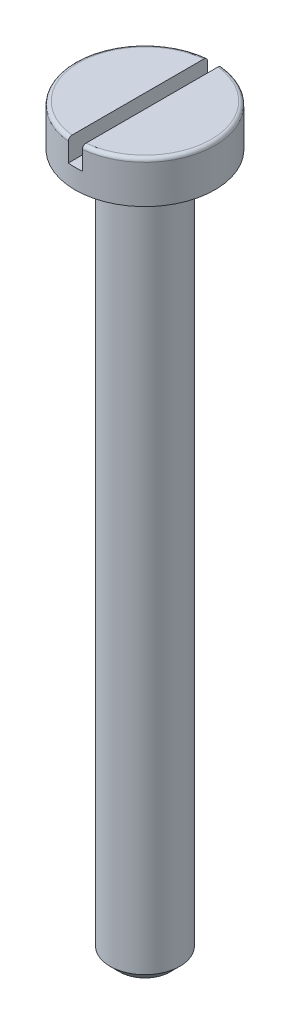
ISO-10303-21;
HEADER;
FILE_DESCRIPTION(('STEP AP214'),'2;1');
FILE_NAME('part.step','',(''),(''),'','','');
FILE_SCHEMA(('AUTOMOTIVE_DESIGN { 1 0 10303 214 1 1 1 1 }'));
ENDSEC;
DATA;
#1=APPLICATION_CONTEXT('core data for automotive mechanical design processes');
#2=APPLICATION_PROTOCOL_DEFINITION('international standard','automotive_design',2000,#1);
#3=PRODUCT_CONTEXT('',#1,'mechanical');
#4=PRODUCT('Part','Part','',(#3));
#5=PRODUCT_RELATED_PRODUCT_CATEGORY('part','',(#4));
#6=PRODUCT_DEFINITION_FORMATION('','',#4);
#7=PRODUCT_DEFINITION_CONTEXT('part definition',#1,'design');
#8=PRODUCT_DEFINITION('design','',#6,#7);
#9=PRODUCT_DEFINITION_SHAPE('','',#8);
#10=(LENGTH_UNIT() NAMED_UNIT(*) SI_UNIT(.MILLI.,.METRE.));
#11=(NAMED_UNIT(*) PLANE_ANGLE_UNIT() SI_UNIT($,.RADIAN.));
#12=(NAMED_UNIT(*) SI_UNIT($,.STERADIAN.) SOLID_ANGLE_UNIT());
#13=UNCERTAINTY_MEASURE_WITH_UNIT(LENGTH_MEASURE(1.E-05),#10,'distance_accuracy_value','');
#14=(GEOMETRIC_REPRESENTATION_CONTEXT(3) GLOBAL_UNCERTAINTY_ASSIGNED_CONTEXT((#13)) GLOBAL_UNIT_ASSIGNED_CONTEXT((#10,
#11,#12)) REPRESENTATION_CONTEXT('',''));
#15=CARTESIAN_POINT('',(0.,0.,0.));
#16=DIRECTION('',(0.,0.,1.));
#17=DIRECTION('',(1.,0.,0.));
#18=AXIS2_PLACEMENT_3D('',#15,#16,#17);
#19=CARTESIAN_POINT('',(0.,1.5,0.));
#20=DIRECTION('',(0.,-1.,0.));
#21=DIRECTION('',(0.,0.,-1.));
#22=AXIS2_PLACEMENT_3D('',#19,#20,#21);
#23=PLANE('',#22);
#24=CARTESIAN_POINT('',(0.,1.5,0.));
#25=DIRECTION('',(0.,1.,0.));
#26=DIRECTION('',(0.,0.,1.));
#27=AXIS2_PLACEMENT_3D('',#24,#25,#26);
#28=CIRCLE('',#27,2.37);
#29=CARTESIAN_POINT('',(-0.25,1.5,-2.35677746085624));
#30=VERTEX_POINT('',#29);
#31=CARTESIAN_POINT('',(-0.25,1.5,2.35677746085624));
#32=VERTEX_POINT('',#31);
#33=EDGE_CURVE('E96',#30,#32,#28,.T.);
#34=ORIENTED_EDGE('',*,*,#33,.T.);
#35=DIRECTION('',(0.,0.,1.));
#36=VECTOR('',#35,1.);
#37=CARTESIAN_POINT('',(-0.25,1.5,-2.5));
#38=LINE('',#37,#36);
#39=EDGE_CURVE('E87',#30,#32,#38,.T.);
#40=ORIENTED_EDGE('',*,*,#39,.F.);
#41=EDGE_LOOP('',(#34,#40));
#42=FACE_BOUND('',#41,.T.);
#43=ADVANCED_FACE('F33',(#42),#23,.F.);
#44=CARTESIAN_POINT('',(0.,1.37,0.));
#45=DIRECTION('',(0.,1.,0.));
#46=DIRECTION('',(0.,0.,1.));
#47=AXIS2_PLACEMENT_3D('',#44,#45,#46);
#48=TOROIDAL_SURFACE('',#47,2.37,0.13);
#49=ORIENTED_EDGE('',*,*,#33,.F.);
#50=CARTESIAN_POINT('',(-0.25,1.43911937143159,-2.46746982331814));
#51=CARTESIAN_POINT('',(-0.25,1.43296494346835,-2.47135281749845));
#52=CARTESIAN_POINT('',(-0.25,1.42647907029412,-2.47472015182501));
#53=CARTESIAN_POINT('',(-0.25,1.41302891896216,-2.48032132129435));
#54=CARTESIAN_POINT('',(-0.25,1.40606409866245,-2.4825538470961));
#55=CARTESIAN_POINT('',(-0.25,1.39186015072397,-2.48581591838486));
#56=CARTESIAN_POINT('',(-0.25,1.38462112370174,-2.48684590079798));
#57=CARTESIAN_POINT('',(-0.25,1.37007485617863,-2.48767352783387));
#58=CARTESIAN_POINT('',(-0.25,1.36276763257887,-2.48747147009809));
#59=CARTESIAN_POINT('',(-0.25,1.34830107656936,-2.48584291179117));
#60=CARTESIAN_POINT('',(-0.25,1.34114155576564,-2.48441808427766));
#61=CARTESIAN_POINT('',(-0.25,1.32716277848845,-2.48038766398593));
#62=CARTESIAN_POINT('',(-0.25,1.32034353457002,-2.47778202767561));
#63=CARTESIAN_POINT('',(-0.25,1.30723188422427,-2.47146272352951));
#64=CARTESIAN_POINT('',(-0.25,1.30093995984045,-2.46774805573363));
#65=CARTESIAN_POINT('',(-0.25,1.28906611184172,-2.45931875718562));
#66=CARTESIAN_POINT('',(-0.25,1.2834841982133,-2.45460411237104));
#67=CARTESIAN_POINT('',(-0.25,1.27316640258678,-2.44429081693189));
#68=CARTESIAN_POINT('',(-0.25,1.26843369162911,-2.43868899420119));
#69=CARTESIAN_POINT('',(-0.25,1.25997030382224,-2.4267736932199));
#70=CARTESIAN_POINT('',(-0.25,1.25623965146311,-2.42046019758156));
#71=CARTESIAN_POINT('',(-0.25,1.24986634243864,-2.40726673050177));
#72=CARTESIAN_POINT('',(-0.25,1.24722926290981,-2.40038406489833));
#73=CARTESIAN_POINT('',(-0.25,1.24314226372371,-2.38627484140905));
#74=CARTESIAN_POINT('',(-0.25,1.24169237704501,-2.37904827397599));
#75=CARTESIAN_POINT('',(-0.25,1.24001521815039,-2.36442203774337));
#76=CARTESIAN_POINT('',(-0.25,1.23979340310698,-2.35702174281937));
#77=CARTESIAN_POINT('',(-0.25,1.24059274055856,-2.34228852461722));
#78=CARTESIAN_POINT('',(-0.25,1.24161391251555,-2.33495560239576));
#79=CARTESIAN_POINT('',(-0.25,1.24487407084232,-2.32055094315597));
#80=CARTESIAN_POINT('',(-0.25,1.24711535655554,-2.31347972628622));
#81=CARTESIAN_POINT('',(-0.25,1.2527552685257,-2.29981484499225));
#82=CARTESIAN_POINT('',(-0.25,1.25615389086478,-2.2932211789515));
#83=CARTESIAN_POINT('',(-0.25,1.26400708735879,-2.28071187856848));
#84=CARTESIAN_POINT('',(-0.25,1.26845980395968,-2.27479507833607));
#85=CARTESIAN_POINT('',(-0.25,1.27829987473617,-2.26379762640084));
#86=CARTESIAN_POINT('',(-0.25,1.28368720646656,-2.25871695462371));
#87=CARTESIAN_POINT('',(-0.25,1.2952158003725,-2.24956319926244));
#88=CARTESIAN_POINT('',(-0.25,1.30135323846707,-2.24548529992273));
#89=CARTESIAN_POINT('',(-0.25,1.31422883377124,-2.23842492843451));
#90=CARTESIAN_POINT('',(-0.25,1.32096697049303,-2.23544241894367));
#91=CARTESIAN_POINT('',(-0.25,1.3348099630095,-2.23067557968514));
#92=CARTESIAN_POINT('',(-0.25,1.34191242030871,-2.22888428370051));
#93=CARTESIAN_POINT('',(-0.25,1.3563176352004,-2.22652489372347));
#94=CARTESIAN_POINT('',(-0.25,1.36362038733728,-2.22595676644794));
#95=CARTESIAN_POINT('',(-0.25,1.37818766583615,-2.22606033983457));
#96=CARTESIAN_POINT('',(-0.25,1.38545222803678,-2.22672707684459));
#97=CARTESIAN_POINT('',(-0.25,1.39976615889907,-2.22927090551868));
#98=CARTESIAN_POINT('',(-0.25,1.40681552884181,-2.23114798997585));
#99=CARTESIAN_POINT('',(-0.25,1.42049920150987,-2.23605713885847));
#100=CARTESIAN_POINT('',(-0.25,1.42713353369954,-2.23908912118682));
#101=CARTESIAN_POINT('',(-0.25,1.43980169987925,-2.24621970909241));
#102=CARTESIAN_POINT('',(-0.25,1.44583552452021,-2.25031833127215));
#103=CARTESIAN_POINT('',(-0.25,1.45715719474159,-2.25948194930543));
#104=CARTESIAN_POINT('',(-0.25,1.46244205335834,-2.26455063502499));
#105=CARTESIAN_POINT('',(-0.25,1.4720918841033,-2.27549874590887));
#106=CARTESIAN_POINT('',(-0.25,1.47645682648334,-2.28137819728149));
#107=CARTESIAN_POINT('',(-0.25,1.48416996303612,-2.29381777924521));
#108=CARTESIAN_POINT('',(-0.25,1.48751205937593,-2.30038169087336));
#109=CARTESIAN_POINT('',(-0.25,1.49305316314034,-2.31397547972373));
#110=CARTESIAN_POINT('',(-0.25,1.49525213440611,-2.32100537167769));
#111=CARTESIAN_POINT('',(-0.25,1.498454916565,-2.33536951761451));
#112=CARTESIAN_POINT('',(-0.25,1.49945266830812,-2.34270512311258));
#113=CARTESIAN_POINT('',(-0.25,1.50020513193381,-2.357439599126));
#114=CARTESIAN_POINT('',(-0.25,1.49995987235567,-2.36483846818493));
#115=CARTESIAN_POINT('',(-0.25,1.49823112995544,-2.37950421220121));
#116=CARTESIAN_POINT('',(-0.25,1.4967453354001,-2.38677081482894));
#117=CARTESIAN_POINT('',(-0.25,1.49257232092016,-2.40095268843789));
#118=CARTESIAN_POINT('',(-0.25,1.48988480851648,-2.40786787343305));
#119=CARTESIAN_POINT('',(-0.25,1.48338728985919,-2.42113804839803));
#120=CARTESIAN_POINT('',(-0.25,1.47957864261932,-2.42749370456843));
#121=CARTESIAN_POINT('',(-0.25,1.47094630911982,-2.43946569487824));
#122=CARTESIAN_POINT('',(-0.25,1.46612387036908,-2.44508292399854));
#123=CARTESIAN_POINT('',(-0.25,1.45756075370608,-2.45349644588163));
#124=CARTESIAN_POINT('',(-0.25,1.45408360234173,-2.45656555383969));
#125=CARTESIAN_POINT('',(-0.25,1.44682221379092,-2.46231606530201));
#126=CARTESIAN_POINT('',(-0.25,1.44303797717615,-2.464997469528));
#127=CARTESIAN_POINT('',(-0.25,1.43911937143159,-2.46746982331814));
#128=B_SPLINE_CURVE_WITH_KNOTS('',3,(#50,#51,#52,#53,#54,#55,#56,#57,#58,#59,#60,#61,#62,#63,
#64,#65,#66,#67,#68,#69,#70,#71,#72,#73,#74,#75,#76,#77,#78,#79,#80,#81,#82,#83,#84,#85,#86,#87,
#88,#89,#90,#91,#92,#93,#94,#95,#96,#97,#98,#99,#100,#101,#102,#103,#104,#105,#106,#107,#108,
#109,#110,#111,#112,#113,#114,#115,#116,#117,#118,#119,#120,#121,#122,#123,#124,#125,#126,#127),
.UNSPECIFIED.,.T.,.F.,(4,2,2,2,2,2,2,2,2,2,2,2,2,2,2,2,2,2,2,2,2,2,2,2,2,2,2,2,2,2,2,2,2,2,2,2,
2,2,4),(0.,0.0218141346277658,0.0436533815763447,0.0654846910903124,0.0873107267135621,
0.109106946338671,0.130903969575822,0.152720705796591,0.174537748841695,0.196434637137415,
0.218332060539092,0.240339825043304,0.262348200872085,0.284454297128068,0.306560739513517,
0.328708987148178,0.350857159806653,0.372966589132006,0.395075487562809,0.417076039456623,
0.439075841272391,0.460945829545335,0.482815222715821,0.504596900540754,0.526378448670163,
0.548158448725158,0.569938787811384,0.591803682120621,0.613669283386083,0.635662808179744,
0.65765702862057,0.679761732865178,0.70186592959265,0.724011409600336,0.746162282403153,
0.768286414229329,0.790383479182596,0.804272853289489,0.818162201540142),.UNSPECIFIED.);
#129=CARTESIAN_POINT('',(-0.25,1.36999999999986,-2.48746859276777));
#130=VERTEX_POINT('',#129);
#131=EDGE_CURVE('E84',#30,#130,#128,.T.);
#132=ORIENTED_EDGE('',*,*,#131,.T.);
#133=CARTESIAN_POINT('',(0.,1.37,0.));
#134=DIRECTION('',(0.,1.,0.));
#135=DIRECTION('',(0.,0.,1.));
#136=AXIS2_PLACEMENT_3D('',#133,#134,#135);
#137=CIRCLE('',#136,2.5);
#138=CARTESIAN_POINT('',(-0.25,1.37000000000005,2.48746859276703));
#139=VERTEX_POINT('',#138);
#140=EDGE_CURVE('E103',#130,#139,#137,.T.);
#141=ORIENTED_EDGE('',*,*,#140,.T.);
#142=CARTESIAN_POINT('',(-0.25,1.42827001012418,2.23988223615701));
#143=CARTESIAN_POINT('',(-0.25,1.42178303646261,2.23660967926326));
#144=CARTESIAN_POINT('',(-0.25,1.41501584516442,2.23388116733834));
#145=CARTESIAN_POINT('',(-0.25,1.40111402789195,2.22959648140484));
#146=CARTESIAN_POINT('',(-0.25,1.39397899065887,2.2280416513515));
#147=CARTESIAN_POINT('',(-0.25,1.37955103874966,2.22615388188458));
#148=CARTESIAN_POINT('',(-0.25,1.37225818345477,2.22582049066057));
#149=CARTESIAN_POINT('',(-0.25,1.35772216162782,2.22638464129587));
#150=CARTESIAN_POINT('',(-0.25,1.35047898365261,2.22728188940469));
#151=CARTESIAN_POINT('',(-0.25,1.33625385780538,2.23027853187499));
#152=CARTESIAN_POINT('',(-0.25,1.32927164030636,2.23237664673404));
#153=CARTESIAN_POINT('',(-0.25,1.31575706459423,2.23771263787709));
#154=CARTESIAN_POINT('',(-0.25,1.30922472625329,2.24095056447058));
#155=CARTESIAN_POINT('',(-0.25,1.2967779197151,2.24848114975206));
#156=CARTESIAN_POINT('',(-0.25,1.29086497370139,2.25277632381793));
#157=CARTESIAN_POINT('',(-0.25,1.27983920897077,2.2622934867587));
#158=CARTESIAN_POINT('',(-0.25,1.27472641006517,2.26751549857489));
#159=CARTESIAN_POINT('',(-0.25,1.26541640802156,2.27876789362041));
#160=CARTESIAN_POINT('',(-0.25,1.26122427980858,2.28480247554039));
#161=CARTESIAN_POINT('',(-0.25,1.25390591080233,2.29748658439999));
#162=CARTESIAN_POINT('',(-0.25,1.25077970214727,2.30413612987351));
#163=CARTESIAN_POINT('',(-0.25,1.24566392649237,2.31790205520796));
#164=CARTESIAN_POINT('',(-0.25,1.24368091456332,2.32502087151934));
#165=CARTESIAN_POINT('',(-0.25,1.24093365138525,2.33948996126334));
#166=CARTESIAN_POINT('',(-0.25,1.2401694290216,2.34684024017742));
#167=CARTESIAN_POINT('',(-0.25,1.2398805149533,2.36159008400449));
#168=CARTESIAN_POINT('',(-0.25,1.24036001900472,2.36898973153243));
#169=CARTESIAN_POINT('',(-0.25,1.24255472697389,2.3836035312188));
#170=CARTESIAN_POINT('',(-0.25,1.24426993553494,2.39081768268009));
#171=CARTESIAN_POINT('',(-0.25,1.24888858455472,2.40485327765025));
#172=CARTESIAN_POINT('',(-0.25,1.25179174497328,2.41167481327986));
#173=CARTESIAN_POINT('',(-0.25,1.25870596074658,2.4247312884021));
#174=CARTESIAN_POINT('',(-0.25,1.26271699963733,2.43096623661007));
#175=CARTESIAN_POINT('',(-0.25,1.27171897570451,2.44264879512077));
#176=CARTESIAN_POINT('',(-0.25,1.27670646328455,2.448099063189));
#177=CARTESIAN_POINT('',(-0.25,1.28752981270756,2.45807967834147));
#178=CARTESIAN_POINT('',(-0.25,1.29336565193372,2.46261004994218));
#179=CARTESIAN_POINT('',(-0.25,1.30568850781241,2.47059795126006));
#180=CARTESIAN_POINT('',(-0.25,1.31217209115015,2.47406077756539));
#181=CARTESIAN_POINT('',(-0.25,1.32563049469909,2.47984309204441));
#182=CARTESIAN_POINT('',(-0.25,1.33260530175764,2.48216261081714));
#183=CARTESIAN_POINT('',(-0.25,1.34681431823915,2.48558233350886));
#184=CARTESIAN_POINT('',(-0.25,1.35404721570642,2.48668799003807));
#185=CARTESIAN_POINT('',(-0.25,1.36859587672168,2.48766627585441));
#186=CARTESIAN_POINT('',(-0.25,1.37591163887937,2.48753892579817));
#187=CARTESIAN_POINT('',(-0.25,1.39040100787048,2.48605665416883));
#188=CARTESIAN_POINT('',(-0.25,1.39757489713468,2.48470449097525));
#189=CARTESIAN_POINT('',(-0.25,1.41159411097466,2.48081590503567));
#190=CARTESIAN_POINT('',(-0.25,1.41843943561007,2.47827948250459));
#191=CARTESIAN_POINT('',(-0.25,1.43161392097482,2.47209342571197));
#192=CARTESIAN_POINT('',(-0.25,1.43794264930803,2.46844287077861));
#193=CARTESIAN_POINT('',(-0.25,1.44990025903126,2.46013466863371));
#194=CARTESIAN_POINT('',(-0.25,1.4555291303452,2.45547700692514));
#195=CARTESIAN_POINT('',(-0.25,1.4659494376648,2.44526952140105));
#196=CARTESIAN_POINT('',(-0.25,1.47073779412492,2.43971655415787));
#197=CARTESIAN_POINT('',(-0.25,1.47931984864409,2.42788895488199));
#198=CARTESIAN_POINT('',(-0.25,1.4831135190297,2.42161430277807));
#199=CARTESIAN_POINT('',(-0.25,1.48961873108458,2.40848775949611));
#200=CARTESIAN_POINT('',(-0.25,1.49232474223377,2.40163312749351));
#201=CARTESIAN_POINT('',(-0.25,1.49655338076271,2.38756806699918));
#202=CARTESIAN_POINT('',(-0.25,1.49807597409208,2.38035762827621));
#203=CARTESIAN_POINT('',(-0.25,1.49990072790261,2.36575085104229));
#204=CARTESIAN_POINT('',(-0.25,1.50019735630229,2.35835382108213));
#205=CARTESIAN_POINT('',(-0.25,1.49954724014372,2.34361481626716));
#206=CARTESIAN_POINT('',(-0.25,1.49860052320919,2.33627284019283));
#207=CARTESIAN_POINT('',(-0.25,1.49548711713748,2.32183769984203));
#208=CARTESIAN_POINT('',(-0.25,1.49331813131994,2.31474503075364));
#209=CARTESIAN_POINT('',(-0.25,1.48781759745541,2.30102344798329));
#210=CARTESIAN_POINT('',(-0.25,1.48448576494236,2.29439464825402));
#211=CARTESIAN_POINT('',(-0.25,1.47675756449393,2.28180103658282));
#212=CARTESIAN_POINT('',(-0.25,1.47236243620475,2.27583546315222));
#213=CARTESIAN_POINT('',(-0.25,1.46263145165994,2.26473715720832));
#214=CARTESIAN_POINT('',(-0.25,1.45729675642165,2.25960341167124));
#215=CARTESIAN_POINT('',(-0.25,1.44797002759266,2.25204072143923));
#216=CARTESIAN_POINT('',(-0.25,1.44421445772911,2.24931504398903));
#217=CARTESIAN_POINT('',(-0.25,1.43643395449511,2.24427982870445));
#218=CARTESIAN_POINT('',(-0.25,1.43240902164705,2.24197029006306));
#219=CARTESIAN_POINT('',(-0.25,1.42827001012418,2.23988223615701));
#220=B_SPLINE_CURVE_WITH_KNOTS('',3,(#142,#143,#144,#145,#146,#147,#148,#149,#150,#151,#152,
#153,#154,#155,#156,#157,#158,#159,#160,#161,#162,#163,#164,#165,#166,#167,#168,#169,#170,#171,
#172,#173,#174,#175,#176,#177,#178,#179,#180,#181,#182,#183,#184,#185,#186,#187,#188,#189,#190,
#191,#192,#193,#194,#195,#196,#197,#198,#199,#200,#201,#202,#203,#204,#205,#206,#207,#208,#209,
#210,#211,#212,#213,#214,#215,#216,#217,#218,#219),.UNSPECIFIED.,.T.,.F.,(4,2,2,2,2,2,2,2,2,2,2,
2,2,2,2,2,2,2,2,2,2,2,2,2,2,2,2,2,2,2,2,2,2,2,2,2,2,2,4),(0.,0.0217802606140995,
0.0435854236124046,0.0653825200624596,0.0871744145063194,0.108943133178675,0.130712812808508,
0.152534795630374,0.17435731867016,0.196297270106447,0.218237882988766,0.240303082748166,
0.262368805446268,0.284509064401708,0.306649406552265,0.328784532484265,0.350919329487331,
0.372977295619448,0.395034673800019,0.416980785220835,0.438926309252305,0.460772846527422,
0.48261901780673,0.504416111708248,0.526213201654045,0.548028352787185,0.569843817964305,
0.591737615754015,0.61363202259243,0.635636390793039,0.657641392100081,0.679745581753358,
0.701849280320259,0.723994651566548,0.746145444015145,0.76827053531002,0.790368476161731,
0.804265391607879,0.818162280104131),.UNSPECIFIED.);
#221=EDGE_CURVE('E93',#139,#32,#220,.T.);
#222=ORIENTED_EDGE('',*,*,#221,.T.);
#223=EDGE_LOOP('',(#49,#132,#141,#222));
#224=FACE_BOUND('',#223,.T.);
#225=ADVANCED_FACE('F99',(#224),#48,.T.);
#226=CARTESIAN_POINT('',(0.,-25.,0.));
#227=DIRECTION('',(0.,1.,0.));
#228=DIRECTION('',(0.,0.,1.));
#229=AXIS2_PLACEMENT_3D('',#226,#227,#228);
#230=CYLINDRICAL_SURFACE('',#229,1.25);
#231=CARTESIAN_POINT('',(0.,-24.65,0.));
#232=DIRECTION('',(0.,1.,0.));
#233=DIRECTION('',(0.,0.,1.));
#234=AXIS2_PLACEMENT_3D('',#231,#232,#233);
#235=CIRCLE('',#234,1.25);
#236=CARTESIAN_POINT('',(0.,-24.65,1.25));
#237=VERTEX_POINT('',#236);
#238=EDGE_CURVE('E116',#237,#237,#235,.T.);
#239=ORIENTED_EDGE('',*,*,#238,.T.);
#240=EDGE_LOOP('',(#239));
#241=FACE_BOUND('',#240,.T.);
#242=CARTESIAN_POINT('',(0.,0.,0.));
#243=DIRECTION('',(0.,1.,0.));
#244=DIRECTION('',(0.,0.,1.));
#245=AXIS2_PLACEMENT_3D('',#242,#243,#244);
#246=CIRCLE('',#245,1.25);
#247=CARTESIAN_POINT('',(0.,0.,1.25));
#248=VERTEX_POINT('',#247);
#249=EDGE_CURVE('E113',#248,#248,#246,.T.);
#250=ORIENTED_EDGE('',*,*,#249,.F.);
#251=EDGE_LOOP('',(#250));
#252=FACE_BOUND('',#251,.T.);
#253=ADVANCED_FACE('F184',(#241,#252),#230,.T.);
#254=CARTESIAN_POINT('',(0.,-25.,0.));
#255=DIRECTION('',(0.,1.,0.));
#256=DIRECTION('',(0.,0.,1.));
#257=AXIS2_PLACEMENT_3D('',#254,#255,#256);
#258=PLANE('',#257);
#259=CARTESIAN_POINT('',(0.,-25.,0.));
#260=DIRECTION('',(0.,1.,0.));
#261=DIRECTION('',(0.,0.,1.));
#262=AXIS2_PLACEMENT_3D('',#259,#260,#261);
#263=CIRCLE('',#262,0.899999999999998);
#264=CARTESIAN_POINT('',(0.,-25.,0.899999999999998));
#265=VERTEX_POINT('',#264);
#266=EDGE_CURVE('E119',#265,#265,#263,.F.);
#267=ORIENTED_EDGE('',*,*,#266,.T.);
#268=EDGE_LOOP('',(#267));
#269=FACE_BOUND('',#268,.T.);
#270=ADVANCED_FACE('F194',(#269),#258,.F.);
#271=CARTESIAN_POINT('',(0.,-24.65,0.));
#272=DIRECTION('',(0.,1.,0.));
#273=DIRECTION('',(0.,0.,1.));
#274=AXIS2_PLACEMENT_3D('',#271,#272,#273);
#275=CONICAL_SURFACE('',#274,1.25,0.785398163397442);
#276=ORIENTED_EDGE('',*,*,#266,.F.);
#277=EDGE_LOOP('',(#276));
#278=FACE_BOUND('',#277,.T.);
#279=ORIENTED_EDGE('',*,*,#238,.F.);
#280=EDGE_LOOP('',(#279));
#281=FACE_BOUND('',#280,.T.);
#282=ADVANCED_FACE('F35',(#278,#281),#275,.T.);
#283=CARTESIAN_POINT('',(0.25,1.5,2.35677746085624));
#284=VERTEX_POINT('',#283);
#285=CARTESIAN_POINT('',(0.25,1.5,-2.35677746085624));
#286=VERTEX_POINT('',#285);
#287=EDGE_CURVE('E100',#284,#286,#28,.T.);
#288=ORIENTED_EDGE('',*,*,#287,.T.);
#289=DIRECTION('',(0.,0.,-1.));
#290=VECTOR('',#289,1.);
#291=CARTESIAN_POINT('',(0.25,1.5,-2.5));
#292=LINE('',#291,#290);
#293=EDGE_CURVE('E97',#284,#286,#292,.T.);
#294=ORIENTED_EDGE('',*,*,#293,.F.);
#295=EDGE_LOOP('',(#288,#294));
#296=FACE_BOUND('',#295,.T.);
#297=ADVANCED_FACE('F158',(#296),#23,.F.);
#298=CARTESIAN_POINT('',(0.,0.,0.));
#299=DIRECTION('',(0.,1.,0.));
#300=DIRECTION('',(0.,0.,1.));
#301=AXIS2_PLACEMENT_3D('',#298,#299,#300);
#302=PLANE('',#301);
#303=ORIENTED_EDGE('',*,*,#249,.T.);
#304=EDGE_LOOP('',(#303));
#305=FACE_BOUND('',#304,.T.);
#306=CARTESIAN_POINT('',(0.,0.,0.));
#307=DIRECTION('',(0.,1.,0.));
#308=DIRECTION('',(0.,0.,1.));
#309=AXIS2_PLACEMENT_3D('',#306,#307,#308);
#310=CIRCLE('',#309,2.5);
#311=CARTESIAN_POINT('',(0.,0.,2.5));
#312=VERTEX_POINT('',#311);
#313=EDGE_CURVE('E110',#312,#312,#310,.T.);
#314=ORIENTED_EDGE('',*,*,#313,.F.);
#315=EDGE_LOOP('',(#314));
#316=FACE_BOUND('',#315,.T.);
#317=ADVANCED_FACE('F188',(#305,#316),#302,.F.);
#318=CARTESIAN_POINT('',(0.,1.3,0.));
#319=DIRECTION('',(0.,1.,0.));
#320=DIRECTION('',(0.,0.,1.));
#321=AXIS2_PLACEMENT_3D('',#318,#319,#320);
#322=CYLINDRICAL_SURFACE('',#321,2.5);
#323=ORIENTED_EDGE('',*,*,#140,.F.);
#324=DIRECTION('',(0.,1.,0.));
#325=VECTOR('',#324,1.);
#326=CARTESIAN_POINT('',(-0.25,1.3,-2.48746859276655));
#327=LINE('',#326,#325);
#328=CARTESIAN_POINT('',(-0.25,0.7,-2.48746859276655));
#329=VERTEX_POINT('',#328);
#330=EDGE_CURVE('E56',#130,#329,#327,.F.);
#331=ORIENTED_EDGE('',*,*,#330,.T.);
#332=CARTESIAN_POINT('',(0.,0.7,0.));
#333=DIRECTION('',(0.,1.,0.));
#334=DIRECTION('',(0.,0.,1.));
#335=AXIS2_PLACEMENT_3D('',#332,#333,#334);
#336=CIRCLE('',#335,2.5);
#337=CARTESIAN_POINT('',(0.25,0.7,-2.48746859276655));
#338=VERTEX_POINT('',#337);
#339=EDGE_CURVE('E11',#338,#329,#336,.T.);
#340=ORIENTED_EDGE('',*,*,#339,.F.);
#341=DIRECTION('',(0.,1.,0.));
#342=VECTOR('',#341,1.);
#343=CARTESIAN_POINT('',(0.25,1.3,-2.48746859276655));
#344=LINE('',#343,#342);
#345=CARTESIAN_POINT('',(0.25,1.37,-2.48746859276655));
#346=VERTEX_POINT('',#345);
#347=EDGE_CURVE('E167',#338,#346,#344,.T.);
#348=ORIENTED_EDGE('',*,*,#347,.T.);
#349=CARTESIAN_POINT('',(0.25,1.37,2.48746859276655));
#350=VERTEX_POINT('',#349);
#351=EDGE_CURVE('E109',#350,#346,#137,.T.);
#352=ORIENTED_EDGE('',*,*,#351,.F.);
#353=DIRECTION('',(0.,1.,0.));
#354=VECTOR('',#353,1.);
#355=CARTESIAN_POINT('',(0.25,1.3,2.48746859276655));
#356=LINE('',#355,#354);
#357=CARTESIAN_POINT('',(0.25,0.7,2.48746859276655));
#358=VERTEX_POINT('',#357);
#359=EDGE_CURVE('E48',#350,#358,#356,.F.);
#360=ORIENTED_EDGE('',*,*,#359,.T.);
#361=CARTESIAN_POINT('',(-0.25,0.7,2.48746859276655));
#362=VERTEX_POINT('',#361);
#363=EDGE_CURVE('E37',#362,#358,#336,.T.);
#364=ORIENTED_EDGE('',*,*,#363,.F.);
#365=DIRECTION('',(0.,1.,0.));
#366=VECTOR('',#365,1.);
#367=CARTESIAN_POINT('',(-0.25,1.3,2.48746859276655));
#368=LINE('',#367,#366);
#369=EDGE_CURVE('E104',#362,#139,#368,.T.);
#370=ORIENTED_EDGE('',*,*,#369,.T.);
#371=EDGE_LOOP('',(#323,#331,#340,#348,#352,#360,#364,#370));
#372=FACE_BOUND('',#371,.T.);
#373=ORIENTED_EDGE('',*,*,#313,.T.);
#374=EDGE_LOOP('',(#373));
#375=FACE_BOUND('',#374,.T.);
#376=ADVANCED_FACE('F171',(#372,#375),#322,.T.);
#377=ORIENTED_EDGE('',*,*,#351,.T.);
#378=CARTESIAN_POINT('',(0.25,1.43911937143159,-2.46746982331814));
#379=CARTESIAN_POINT('',(0.25,1.44531290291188,-2.4635613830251));
#380=CARTESIAN_POINT('',(0.25,1.45117973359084,-2.45912493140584));
#381=CARTESIAN_POINT('',(0.25,1.46208885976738,-2.44932494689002));
#382=CARTESIAN_POINT('',(0.25,1.46713010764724,-2.44396025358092));
#383=CARTESIAN_POINT('',(0.25,1.47623837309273,-2.43246478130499));
#384=CARTESIAN_POINT('',(0.25,1.48030606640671,-2.42633453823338));
#385=CARTESIAN_POINT('',(0.25,1.48735776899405,-2.41348197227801));
#386=CARTESIAN_POINT('',(0.25,1.49034204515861,-2.40675979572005));
#387=CARTESIAN_POINT('',(0.25,1.49515638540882,-2.39288535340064));
#388=CARTESIAN_POINT('',(0.25,1.49698200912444,-2.38573154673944));
#389=CARTESIAN_POINT('',(0.25,1.49941139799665,-2.37121906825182));
#390=CARTESIAN_POINT('',(0.25,1.50001508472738,-2.36386038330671));
#391=CARTESIAN_POINT('',(0.25,1.49998428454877,-2.3491179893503));
#392=CARTESIAN_POINT('',(0.25,1.49934515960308,-2.34173428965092));
#393=CARTESIAN_POINT('',(0.25,1.49683735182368,-2.32717865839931));
#394=CARTESIAN_POINT('',(0.25,1.49496865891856,-2.3200067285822));
#395=CARTESIAN_POINT('',(0.25,1.490051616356,-2.3060736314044));
#396=CARTESIAN_POINT('',(0.25,1.48700245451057,-2.29931275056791));
#397=CARTESIAN_POINT('',(0.25,1.47980910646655,-2.28640093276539));
#398=CARTESIAN_POINT('',(0.25,1.47566493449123,-2.28024998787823));
#399=CARTESIAN_POINT('',(0.25,1.46641129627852,-2.26875323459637));
#400=CARTESIAN_POINT('',(0.25,1.46130474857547,-2.26340507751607));
#401=CARTESIAN_POINT('',(0.25,1.45026180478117,-2.25364782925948));
#402=CARTESIAN_POINT('',(0.25,1.44432543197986,-2.24923871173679));
#403=CARTESIAN_POINT('',(0.25,1.43182649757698,-2.24151111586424));
#404=CARTESIAN_POINT('',(0.25,1.42526759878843,-2.23818671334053));
#405=CARTESIAN_POINT('',(0.25,1.41168257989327,-2.23269332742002));
#406=CARTESIAN_POINT('',(0.25,1.40465647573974,-2.23052430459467));
#407=CARTESIAN_POINT('',(0.25,1.39037852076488,-2.22741492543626));
#408=CARTESIAN_POINT('',(0.25,1.38312814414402,-2.22646779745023));
#409=CARTESIAN_POINT('',(0.25,1.36857150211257,-2.22580800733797));
#410=CARTESIAN_POINT('',(0.25,1.36126523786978,-2.22609531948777));
#411=CARTESIAN_POINT('',(0.25,1.3468256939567,-2.22789329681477));
#412=CARTESIAN_POINT('',(0.25,1.33969198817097,-2.22940054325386));
#413=CARTESIAN_POINT('',(0.25,1.32577834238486,-2.23358966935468));
#414=CARTESIAN_POINT('',(0.25,1.3189984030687,-2.23627155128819));
#415=CARTESIAN_POINT('',(0.25,1.30597364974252,-2.24273619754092));
#416=CARTESIAN_POINT('',(0.25,1.29972960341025,-2.2465205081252));
#417=CARTESIAN_POINT('',(0.25,1.28796144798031,-2.25507891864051));
#418=CARTESIAN_POINT('',(0.25,1.28243735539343,-2.25985304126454));
#419=CARTESIAN_POINT('',(0.25,1.27223671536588,-2.27027985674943));
#420=CARTESIAN_POINT('',(0.25,1.26756441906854,-2.27593670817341));
#421=CARTESIAN_POINT('',(0.25,1.25922921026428,-2.2879506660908));
#422=CARTESIAN_POINT('',(0.25,1.25556632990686,-2.29430779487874));
#423=CARTESIAN_POINT('',(0.25,1.2493316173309,-2.30758200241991));
#424=CARTESIAN_POINT('',(0.25,1.24676632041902,-2.31450215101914));
#425=CARTESIAN_POINT('',(0.25,1.24282849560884,-2.32867390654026));
#426=CARTESIAN_POINT('',(0.25,1.24145599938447,-2.33592552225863));
#427=CARTESIAN_POINT('',(0.25,1.23993838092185,-2.3505865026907));
#428=CARTESIAN_POINT('',(0.25,1.23979835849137,-2.35799639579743));
#429=CARTESIAN_POINT('',(0.25,1.24076330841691,-2.37273473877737));
#430=CARTESIAN_POINT('',(0.25,1.24186829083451,-2.38006318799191));
#431=CARTESIAN_POINT('',(0.25,1.24529448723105,-2.39443552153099));
#432=CARTESIAN_POINT('',(0.25,1.24761653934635,-2.40147920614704));
#433=CARTESIAN_POINT('',(0.25,1.25341345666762,-2.41507516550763));
#434=CARTESIAN_POINT('',(0.25,1.25688831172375,-2.42162744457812));
#435=CARTESIAN_POINT('',(0.25,1.264882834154,-2.43403436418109));
#436=CARTESIAN_POINT('',(0.25,1.26939956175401,-2.43989089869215));
#437=CARTESIAN_POINT('',(0.25,1.27935653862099,-2.45075789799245));
#438=CARTESIAN_POINT('',(0.25,1.28479676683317,-2.4557683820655));
#439=CARTESIAN_POINT('',(0.25,1.29641830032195,-2.46477503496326));
#440=CARTESIAN_POINT('',(0.25,1.30259589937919,-2.46877598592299));
#441=CARTESIAN_POINT('',(0.25,1.3155374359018,-2.47567791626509));
#442=CARTESIAN_POINT('',(0.25,1.32230133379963,-2.47857896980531));
#443=CARTESIAN_POINT('',(0.25,1.33618770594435,-2.48318462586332));
#444=CARTESIAN_POINT('',(0.25,1.34330824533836,-2.48489506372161));
#445=CARTESIAN_POINT('',(0.25,1.35773763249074,-2.48709264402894));
#446=CARTESIAN_POINT('',(0.25,1.36504652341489,-2.48757950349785));
#447=CARTESIAN_POINT('',(0.25,1.37962324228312,-2.4873155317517));
#448=CARTESIAN_POINT('',(0.25,1.38689112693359,-2.48656772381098));
#449=CARTESIAN_POINT('',(0.25,1.40119172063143,-2.48386209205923));
#450=CARTESIAN_POINT('',(0.25,1.40822470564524,-2.48190574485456));
#451=CARTESIAN_POINT('',(0.25,1.41924547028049,-2.47781537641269));
#452=CARTESIAN_POINT('',(0.25,1.42336845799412,-2.4760359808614));
#453=CARTESIAN_POINT('',(0.25,1.43140829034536,-2.47206038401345));
#454=CARTESIAN_POINT('',(0.25,1.43532513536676,-2.46986418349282));
#455=CARTESIAN_POINT('',(0.25,1.43911937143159,-2.46746982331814));
#456=B_SPLINE_CURVE_WITH_KNOTS('',3,(#378,#379,#380,#381,#382,#383,#384,#385,#386,#387,#388,
#389,#390,#391,#392,#393,#394,#395,#396,#397,#398,#399,#400,#401,#402,#403,#404,#405,#406,#407,
#408,#409,#410,#411,#412,#413,#414,#415,#416,#417,#418,#419,#420,#421,#422,#423,#424,#425,#426,
#427,#428,#429,#430,#431,#432,#433,#434,#435,#436,#437,#438,#439,#440,#441,#442,#443,#444,#445,
#446,#447,#448,#449,#450,#451,#452,#453,#454,#455),.UNSPECIFIED.,.T.,.F.,(4,2,2,2,2,2,2,2,2,2,2,
2,2,2,2,2,2,2,2,2,2,2,2,2,2,2,2,2,2,2,2,2,2,2,2,2,2,2,4),(0.,0.0219544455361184,
0.0439365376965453,0.0659033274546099,0.0878647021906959,0.109909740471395,0.131956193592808,
0.154085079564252,0.176214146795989,0.19835846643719,0.22050249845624,0.242580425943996,
0.264657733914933,0.286612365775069,0.308566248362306,0.330397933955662,0.352229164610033,
0.373999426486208,0.395769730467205,0.417570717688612,0.43937220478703,0.461279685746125,
0.483187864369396,0.505224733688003,0.527262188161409,0.549390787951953,0.571519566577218,
0.593663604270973,0.615807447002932,0.637889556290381,0.659971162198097,0.681946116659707,
0.703919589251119,0.725784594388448,0.747654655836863,0.769471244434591,0.791261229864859,
0.804710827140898,0.818160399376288),.UNSPECIFIED.);
#457=EDGE_CURVE('E128',#346,#286,#456,.T.);
#458=ORIENTED_EDGE('',*,*,#457,.T.);
#459=ORIENTED_EDGE('',*,*,#287,.F.);
#460=CARTESIAN_POINT('',(0.25,1.42827001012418,2.23988223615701));
#461=CARTESIAN_POINT('',(0.25,1.43480328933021,2.24317888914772));
#462=CARTESIAN_POINT('',(0.25,1.44106182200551,2.24703226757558));
#463=CARTESIAN_POINT('',(0.25,1.45284696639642,2.25574000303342));
#464=CARTESIAN_POINT('',(0.25,1.45837264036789,2.2605956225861));
#465=CARTESIAN_POINT('',(0.25,1.4685279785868,2.27116134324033));
#466=CARTESIAN_POINT('',(0.25,1.47315829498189,2.27687081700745));
#467=CARTESIAN_POINT('',(0.25,1.48139817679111,2.28898159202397));
#468=CARTESIAN_POINT('',(0.25,1.48500799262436,2.2953827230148));
#469=CARTESIAN_POINT('',(0.25,1.49112338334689,2.30872636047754));
#470=CARTESIAN_POINT('',(0.25,1.49362405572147,2.31567111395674));
#471=CARTESIAN_POINT('',(0.25,1.49742942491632,2.3298812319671));
#472=CARTESIAN_POINT('',(0.25,1.49873404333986,2.33714661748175));
#473=CARTESIAN_POINT('',(0.25,1.50011402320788,2.35182294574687));
#474=CARTESIAN_POINT('',(0.25,1.50018439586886,2.35923435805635));
#475=CARTESIAN_POINT('',(0.25,1.49908074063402,2.37396400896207));
#476=CARTESIAN_POINT('',(0.25,1.49790670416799,2.38128224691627));
#477=CARTESIAN_POINT('',(0.25,1.4943450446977,2.39562189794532));
#478=CARTESIAN_POINT('',(0.25,1.49195670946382,2.4026431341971));
#479=CARTESIAN_POINT('',(0.25,1.48603186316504,2.416183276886));
#480=CARTESIAN_POINT('',(0.25,1.48249536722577,2.42270218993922));
#481=CARTESIAN_POINT('',(0.25,1.47438445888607,2.43503198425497));
#482=CARTESIAN_POINT('',(0.25,1.46981305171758,2.44084484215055));
#483=CARTESIAN_POINT('',(0.25,1.45975484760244,2.45161585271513));
#484=CARTESIAN_POINT('',(0.25,1.45426807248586,2.45657402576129));
#485=CARTESIAN_POINT('',(0.25,1.44256343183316,2.46546896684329));
#486=CARTESIAN_POINT('',(0.25,1.43634926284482,2.46941059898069));
#487=CARTESIAN_POINT('',(0.25,1.42334490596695,2.47618877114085));
#488=CARTESIAN_POINT('',(0.25,1.41655473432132,2.47902534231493));
#489=CARTESIAN_POINT('',(0.25,1.40262620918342,2.48349918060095));
#490=CARTESIAN_POINT('',(0.25,1.39548968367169,2.485142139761));
#491=CARTESIAN_POINT('',(0.25,1.38104190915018,2.4872027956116));
#492=CARTESIAN_POINT('',(0.25,1.37373066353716,2.48762051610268));
#493=CARTESIAN_POINT('',(0.25,1.35916318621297,2.48721905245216));
#494=CARTESIAN_POINT('',(0.25,1.35190685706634,2.48640339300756));
#495=CARTESIAN_POINT('',(0.25,1.33763417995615,2.48356551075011));
#496=CARTESIAN_POINT('',(0.25,1.33061783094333,2.48154329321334));
#497=CARTESIAN_POINT('',(0.25,1.31702265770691,2.4763508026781));
#498=CARTESIAN_POINT('',(0.25,1.31044389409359,2.47318037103));
#499=CARTESIAN_POINT('',(0.25,1.2979098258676,2.46578325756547));
#500=CARTESIAN_POINT('',(0.25,1.29195452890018,2.46155656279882));
#501=CARTESIAN_POINT('',(0.25,1.28081627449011,2.45215381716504));
#502=CARTESIAN_POINT('',(0.25,1.27563574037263,2.44697489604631));
#503=CARTESIAN_POINT('',(0.25,1.26621257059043,2.43582452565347));
#504=CARTESIAN_POINT('',(0.25,1.26196995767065,2.4298530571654));
#505=CARTESIAN_POINT('',(0.25,1.25452094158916,2.417256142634));
#506=CARTESIAN_POINT('',(0.25,1.25131967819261,2.41062765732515));
#507=CARTESIAN_POINT('',(0.25,1.24606935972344,2.39692908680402));
#508=CARTESIAN_POINT('',(0.25,1.24402033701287,2.38985898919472));
#509=CARTESIAN_POINT('',(0.25,1.24112311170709,2.37544159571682));
#510=CARTESIAN_POINT('',(0.25,1.24028070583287,2.36809313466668));
#511=CARTESIAN_POINT('',(0.25,1.23983791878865,2.35335884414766));
#512=CARTESIAN_POINT('',(0.25,1.24023756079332,2.3459730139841));
#513=CARTESIAN_POINT('',(0.25,1.24227036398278,2.33135279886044));
#514=CARTESIAN_POINT('',(0.25,1.24390682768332,2.32411887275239));
#515=CARTESIAN_POINT('',(0.25,1.24837191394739,2.31002868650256));
#516=CARTESIAN_POINT('',(0.25,1.25120054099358,2.30317242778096));
#517=CARTESIAN_POINT('',(0.25,1.25796880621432,2.29003909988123));
#518=CARTESIAN_POINT('',(0.25,1.26190753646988,2.28376156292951));
#519=CARTESIAN_POINT('',(0.25,1.27078722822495,2.27196046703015));
#520=CARTESIAN_POINT('',(0.25,1.27572817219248,2.26643689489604));
#521=CARTESIAN_POINT('',(0.25,1.28645035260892,2.25632637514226));
#522=CARTESIAN_POINT('',(0.25,1.29222793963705,2.25173555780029));
#523=CARTESIAN_POINT('',(0.25,1.3044754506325,2.24359610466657));
#524=CARTESIAN_POINT('',(0.25,1.31094532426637,2.24004739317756));
#525=CARTESIAN_POINT('',(0.25,1.32435209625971,2.2341150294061));
#526=CARTESIAN_POINT('',(0.25,1.33128594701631,2.23172448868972));
#527=CARTESIAN_POINT('',(0.25,1.34545952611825,2.22814716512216));
#528=CARTESIAN_POINT('',(0.25,1.35269932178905,2.22696064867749));
#529=CARTESIAN_POINT('',(0.25,1.36724346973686,2.22582979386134));
#530=CARTESIAN_POINT('',(0.25,1.37454741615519,2.22588019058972));
#531=CARTESIAN_POINT('',(0.25,1.38903647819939,2.22720915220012));
#532=CARTESIAN_POINT('',(0.25,1.39622172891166,2.2284862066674));
#533=CARTESIAN_POINT('',(0.25,1.40756582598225,2.23150514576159));
#534=CARTESIAN_POINT('',(0.25,1.41182600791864,2.23287947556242));
#535=CARTESIAN_POINT('',(0.25,1.4201816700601,2.23606063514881));
#536=CARTESIAN_POINT('',(0.25,1.42427715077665,2.23786746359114));
#537=CARTESIAN_POINT('',(0.25,1.42827001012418,2.23988223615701));
#538=B_SPLINE_CURVE_WITH_KNOTS('',3,(#460,#461,#462,#463,#464,#465,#466,#467,#468,#469,#470,
#471,#472,#473,#474,#475,#476,#477,#478,#479,#480,#481,#482,#483,#484,#485,#486,#487,#488,#489,
#490,#491,#492,#493,#494,#495,#496,#497,#498,#499,#500,#501,#502,#503,#504,#505,#506,#507,#508,
#509,#510,#511,#512,#513,#514,#515,#516,#517,#518,#519,#520,#521,#522,#523,#524,#525,#526,#527,
#528,#529,#530,#531,#532,#533,#534,#535,#536,#537),.UNSPECIFIED.,.T.,.F.,(4,2,2,2,2,2,2,2,2,2,2,
2,2,2,2,2,2,2,2,2,2,2,2,2,2,2,2,2,2,2,2,2,2,2,2,2,2,2,4),(0.,0.021937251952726,
0.0439023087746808,0.0658513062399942,0.0877949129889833,0.10983456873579,0.1318756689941,
0.15400583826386,0.176136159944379,0.198279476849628,0.220422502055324,0.242502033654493,
0.264581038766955,0.2865523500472,0.308523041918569,0.330388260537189,0.352253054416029,
0.374055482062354,0.395857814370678,0.417663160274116,0.439468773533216,0.461341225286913,
0.483214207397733,0.505193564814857,0.527173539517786,0.549258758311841,0.571344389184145,
0.593489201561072,0.615634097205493,0.637760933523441,0.659887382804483,0.681920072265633,
0.703951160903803,0.725849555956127,0.747752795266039,0.76956282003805,0.791346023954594,
0.804753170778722,0.818160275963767),.UNSPECIFIED.);
#539=EDGE_CURVE('E122',#284,#350,#538,.T.);
#540=ORIENTED_EDGE('',*,*,#539,.T.);
#541=EDGE_LOOP('',(#377,#458,#459,#540));
#542=FACE_BOUND('',#541,.T.);
#543=ADVANCED_FACE('F132',(#542),#48,.T.);
#544=CARTESIAN_POINT('',(-0.25,0.7,2.5));
#545=DIRECTION('',(0.,1.,0.));
#546=DIRECTION('',(0.,0.,1.));
#547=AXIS2_PLACEMENT_3D('',#544,#545,#546);
#548=PLANE('',#547);
#549=DIRECTION('',(0.,0.,-1.));
#550=VECTOR('',#549,1.);
#551=CARTESIAN_POINT('',(0.25,0.7,-2.5));
#552=LINE('',#551,#550);
#553=EDGE_CURVE('E162',#358,#338,#552,.T.);
#554=ORIENTED_EDGE('',*,*,#553,.T.);
#555=ORIENTED_EDGE('',*,*,#339,.T.);
#556=DIRECTION('',(0.,0.,1.));
#557=VECTOR('',#556,1.);
#558=CARTESIAN_POINT('',(-0.25,0.7,-2.5));
#559=LINE('',#558,#557);
#560=EDGE_CURVE('E159',#329,#362,#559,.T.);
#561=ORIENTED_EDGE('',*,*,#560,.T.);
#562=ORIENTED_EDGE('',*,*,#363,.T.);
#563=EDGE_LOOP('',(#554,#555,#561,#562));
#564=FACE_BOUND('',#563,.T.);
#565=ADVANCED_FACE('F140',(#564),#548,.T.);
#566=CARTESIAN_POINT('',(-0.25,0.7,-2.5));
#567=DIRECTION('',(-1.,0.,0.));
#568=DIRECTION('',(0.,0.,1.));
#569=AXIS2_PLACEMENT_3D('',#566,#567,#568);
#570=PLANE('',#569);
#571=ORIENTED_EDGE('',*,*,#131,.F.);
#572=ORIENTED_EDGE('',*,*,#39,.T.);
#573=ORIENTED_EDGE('',*,*,#221,.F.);
#574=ORIENTED_EDGE('',*,*,#369,.F.);
#575=ORIENTED_EDGE('',*,*,#560,.F.);
#576=ORIENTED_EDGE('',*,*,#330,.F.);
#577=EDGE_LOOP('',(#571,#572,#573,#574,#575,#576));
#578=FACE_BOUND('',#577,.T.);
#579=ADVANCED_FACE('F86',(#578),#570,.F.);
#580=CARTESIAN_POINT('',(0.25,0.7,-2.5));
#581=DIRECTION('',(1.,0.,0.));
#582=DIRECTION('',(0.,0.,-1.));
#583=AXIS2_PLACEMENT_3D('',#580,#581,#582);
#584=PLANE('',#583);
#585=ORIENTED_EDGE('',*,*,#553,.F.);
#586=ORIENTED_EDGE('',*,*,#359,.F.);
#587=ORIENTED_EDGE('',*,*,#539,.F.);
#588=ORIENTED_EDGE('',*,*,#293,.T.);
#589=ORIENTED_EDGE('',*,*,#457,.F.);
#590=ORIENTED_EDGE('',*,*,#347,.F.);
#591=EDGE_LOOP('',(#585,#586,#587,#588,#589,#590));
#592=FACE_BOUND('',#591,.T.);
#593=ADVANCED_FACE('F136',(#592),#584,.F.);
#594=CLOSED_SHELL('',(#43,#225,#253,#270,#282,#297,#317,#376,#543,#565,#579,#593));
#595=MANIFOLD_SOLID_BREP('B2',#594);
#596=ADVANCED_BREP_SHAPE_REPRESENTATION('',(#18,#595),#14);
#597=SHAPE_DEFINITION_REPRESENTATION(#9,#596);
ENDSEC;
END-ISO-10303-21;
